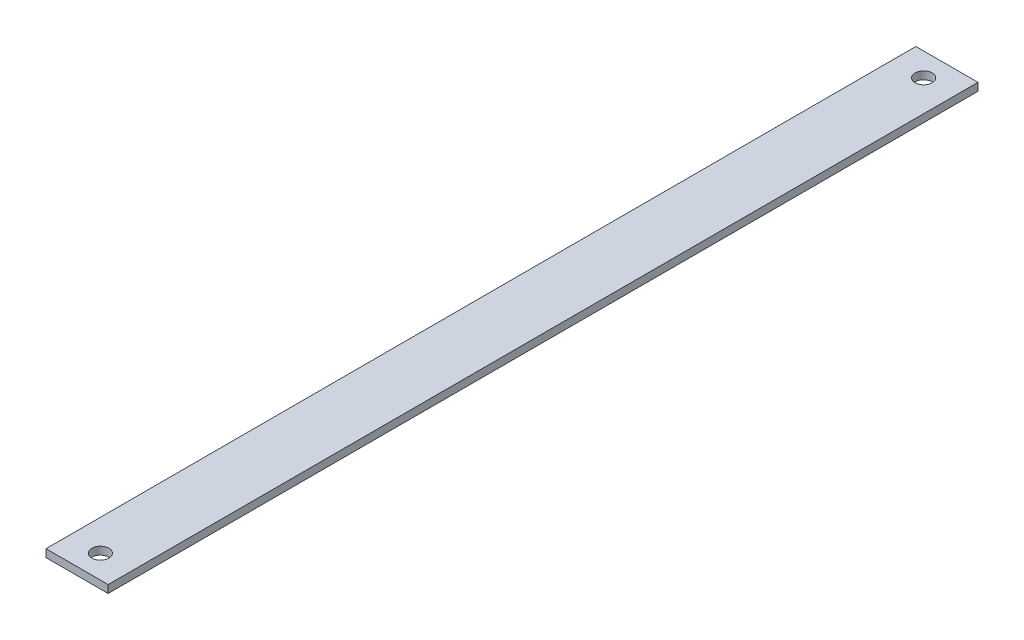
ISO-10303-21;
HEADER;
FILE_DESCRIPTION(('STEP AP214'),'2;1');
FILE_NAME('part.step','',(''),(''),'','','');
FILE_SCHEMA(('AUTOMOTIVE_DESIGN { 1 0 10303 214 1 1 1 1 }'));
ENDSEC;
DATA;
#1=APPLICATION_CONTEXT('core data for automotive mechanical design processes');
#2=APPLICATION_PROTOCOL_DEFINITION('international standard','automotive_design',2000,#1);
#3=PRODUCT_CONTEXT('',#1,'mechanical');
#4=PRODUCT('Part','Part','',(#3));
#5=PRODUCT_RELATED_PRODUCT_CATEGORY('part','',(#4));
#6=PRODUCT_DEFINITION_FORMATION('','',#4);
#7=PRODUCT_DEFINITION_CONTEXT('part definition',#1,'design');
#8=PRODUCT_DEFINITION('design','',#6,#7);
#9=PRODUCT_DEFINITION_SHAPE('','',#8);
#10=(LENGTH_UNIT() NAMED_UNIT(*) SI_UNIT(.MILLI.,.METRE.));
#11=(NAMED_UNIT(*) PLANE_ANGLE_UNIT() SI_UNIT($,.RADIAN.));
#12=(NAMED_UNIT(*) SI_UNIT($,.STERADIAN.) SOLID_ANGLE_UNIT());
#13=UNCERTAINTY_MEASURE_WITH_UNIT(LENGTH_MEASURE(1.E-05),#10,'distance_accuracy_value','');
#14=(GEOMETRIC_REPRESENTATION_CONTEXT(3) GLOBAL_UNCERTAINTY_ASSIGNED_CONTEXT((#13)) GLOBAL_UNIT_ASSIGNED_CONTEXT((#10,
#11,#12)) REPRESENTATION_CONTEXT('',''));
#15=CARTESIAN_POINT('',(0.,0.,0.));
#16=DIRECTION('',(0.,0.,1.));
#17=DIRECTION('',(1.,0.,0.));
#18=AXIS2_PLACEMENT_3D('',#15,#16,#17);
#19=CARTESIAN_POINT('',(0.,0.,560.));
#20=DIRECTION('',(1.,0.,0.));
#21=DIRECTION('',(0.,0.,-1.));
#22=AXIS2_PLACEMENT_3D('',#19,#20,#21);
#23=PLANE('',#22);
#24=DIRECTION('',(0.,-1.,0.));
#25=VECTOR('',#24,1.);
#26=CARTESIAN_POINT('',(0.,0.,0.));
#27=LINE('',#26,#25);
#28=CARTESIAN_POINT('',(0.,5.,0.));
#29=VERTEX_POINT('',#28);
#30=CARTESIAN_POINT('',(0.,0.,0.));
#31=VERTEX_POINT('',#30);
#32=EDGE_CURVE('E73',#29,#31,#27,.T.);
#33=ORIENTED_EDGE('',*,*,#32,.T.);
#34=DIRECTION('',(0.,0.,-1.));
#35=VECTOR('',#34,1.);
#36=CARTESIAN_POINT('',(0.,0.,560.));
#37=LINE('',#36,#35);
#38=CARTESIAN_POINT('',(0.,0.,560.));
#39=VERTEX_POINT('',#38);
#40=EDGE_CURVE('E11',#39,#31,#37,.T.);
#41=ORIENTED_EDGE('',*,*,#40,.F.);
#42=DIRECTION('',(0.,-1.,0.));
#43=VECTOR('',#42,1.);
#44=CARTESIAN_POINT('',(0.,0.,560.));
#45=LINE('',#44,#43);
#46=CARTESIAN_POINT('',(0.,5.,560.));
#47=VERTEX_POINT('',#46);
#48=EDGE_CURVE('E96',#47,#39,#45,.T.);
#49=ORIENTED_EDGE('',*,*,#48,.F.);
#50=DIRECTION('',(0.,0.,-1.));
#51=VECTOR('',#50,1.);
#52=CARTESIAN_POINT('',(0.,5.,560.));
#53=LINE('',#52,#51);
#54=EDGE_CURVE('E85',#47,#29,#53,.T.);
#55=ORIENTED_EDGE('',*,*,#54,.T.);
#56=EDGE_LOOP('',(#33,#41,#49,#55));
#57=FACE_BOUND('',#56,.T.);
#58=ADVANCED_FACE('F29',(#57),#23,.F.);
#59=CARTESIAN_POINT('',(0.,0.,560.));
#60=DIRECTION('',(0.,1.,0.));
#61=DIRECTION('',(0.,0.,1.));
#62=AXIS2_PLACEMENT_3D('',#59,#60,#61);
#63=PLANE('',#62);
#64=CARTESIAN_POINT('',(20.,0.,545.));
#65=DIRECTION('',(0.,1.,0.));
#66=DIRECTION('',(0.,0.,1.));
#67=AXIS2_PLACEMENT_3D('',#64,#65,#66);
#68=CIRCLE('',#67,5.5);
#69=CARTESIAN_POINT('',(20.,0.,550.5));
#70=VERTEX_POINT('',#69);
#71=EDGE_CURVE('E131',#70,#70,#68,.T.);
#72=ORIENTED_EDGE('',*,*,#71,.T.);
#73=EDGE_LOOP('',(#72));
#74=FACE_BOUND('',#73,.T.);
#75=CARTESIAN_POINT('',(20.,0.,15.));
#76=DIRECTION('',(0.,1.,0.));
#77=DIRECTION('',(0.,0.,1.));
#78=AXIS2_PLACEMENT_3D('',#75,#76,#77);
#79=CIRCLE('',#78,5.5);
#80=CARTESIAN_POINT('',(20.,0.,20.5));
#81=VERTEX_POINT('',#80);
#82=EDGE_CURVE('E86',#81,#81,#79,.T.);
#83=ORIENTED_EDGE('',*,*,#82,.T.);
#84=EDGE_LOOP('',(#83));
#85=FACE_BOUND('',#84,.T.);
#86=DIRECTION('',(1.,0.,0.));
#87=VECTOR('',#86,1.);
#88=CARTESIAN_POINT('',(0.,0.,0.));
#89=LINE('',#88,#87);
#90=CARTESIAN_POINT('',(40.,0.,0.));
#91=VERTEX_POINT('',#90);
#92=EDGE_CURVE('E69',#31,#91,#89,.T.);
#93=ORIENTED_EDGE('',*,*,#92,.T.);
#94=DIRECTION('',(0.,0.,-1.));
#95=VECTOR('',#94,1.);
#96=CARTESIAN_POINT('',(40.,0.,560.));
#97=LINE('',#96,#95);
#98=CARTESIAN_POINT('',(40.,0.,560.));
#99=VERTEX_POINT('',#98);
#100=EDGE_CURVE('E36',#99,#91,#97,.T.);
#101=ORIENTED_EDGE('',*,*,#100,.F.);
#102=DIRECTION('',(1.,0.,0.));
#103=VECTOR('',#102,1.);
#104=CARTESIAN_POINT('',(0.,0.,560.));
#105=LINE('',#104,#103);
#106=EDGE_CURVE('E81',#39,#99,#105,.T.);
#107=ORIENTED_EDGE('',*,*,#106,.F.);
#108=ORIENTED_EDGE('',*,*,#40,.T.);
#109=EDGE_LOOP('',(#93,#101,#107,#108));
#110=FACE_BOUND('',#109,.T.);
#111=ADVANCED_FACE('F80',(#74,#85,#110),#63,.F.);
#112=CARTESIAN_POINT('',(40.,0.,560.));
#113=DIRECTION('',(-1.,0.,0.));
#114=DIRECTION('',(0.,0.,1.));
#115=AXIS2_PLACEMENT_3D('',#112,#113,#114);
#116=PLANE('',#115);
#117=DIRECTION('',(0.,1.,0.));
#118=VECTOR('',#117,1.);
#119=CARTESIAN_POINT('',(40.,0.,0.));
#120=LINE('',#119,#118);
#121=CARTESIAN_POINT('',(40.,5.,0.));
#122=VERTEX_POINT('',#121);
#123=EDGE_CURVE('E74',#91,#122,#120,.T.);
#124=ORIENTED_EDGE('',*,*,#123,.T.);
#125=DIRECTION('',(0.,0.,-1.));
#126=VECTOR('',#125,1.);
#127=CARTESIAN_POINT('',(40.,5.,560.));
#128=LINE('',#127,#126);
#129=CARTESIAN_POINT('',(40.,5.,560.));
#130=VERTEX_POINT('',#129);
#131=EDGE_CURVE('E102',#130,#122,#128,.T.);
#132=ORIENTED_EDGE('',*,*,#131,.F.);
#133=DIRECTION('',(0.,1.,0.));
#134=VECTOR('',#133,1.);
#135=CARTESIAN_POINT('',(40.,0.,560.));
#136=LINE('',#135,#134);
#137=EDGE_CURVE('E48',#99,#130,#136,.T.);
#138=ORIENTED_EDGE('',*,*,#137,.F.);
#139=ORIENTED_EDGE('',*,*,#100,.T.);
#140=EDGE_LOOP('',(#124,#132,#138,#139));
#141=FACE_BOUND('',#140,.T.);
#142=ADVANCED_FACE('F105',(#141),#116,.F.);
#143=CARTESIAN_POINT('',(0.,5.,560.));
#144=DIRECTION('',(0.,-1.,0.));
#145=DIRECTION('',(0.,0.,-1.));
#146=AXIS2_PLACEMENT_3D('',#143,#144,#145);
#147=PLANE('',#146);
#148=CARTESIAN_POINT('',(20.,5.,545.));
#149=DIRECTION('',(0.,1.,0.));
#150=DIRECTION('',(0.,0.,1.));
#151=AXIS2_PLACEMENT_3D('',#148,#149,#150);
#152=CIRCLE('',#151,5.5);
#153=CARTESIAN_POINT('',(20.,5.,550.5));
#154=VERTEX_POINT('',#153);
#155=EDGE_CURVE('E141',#154,#154,#152,.T.);
#156=ORIENTED_EDGE('',*,*,#155,.F.);
#157=EDGE_LOOP('',(#156));
#158=FACE_BOUND('',#157,.T.);
#159=CARTESIAN_POINT('',(20.,5.,15.));
#160=DIRECTION('',(0.,1.,0.));
#161=DIRECTION('',(0.,0.,1.));
#162=AXIS2_PLACEMENT_3D('',#159,#160,#161);
#163=CIRCLE('',#162,5.5);
#164=CARTESIAN_POINT('',(20.,5.,20.5));
#165=VERTEX_POINT('',#164);
#166=EDGE_CURVE('E89',#165,#165,#163,.T.);
#167=ORIENTED_EDGE('',*,*,#166,.F.);
#168=EDGE_LOOP('',(#167));
#169=FACE_BOUND('',#168,.T.);
#170=DIRECTION('',(-1.,0.,0.));
#171=VECTOR('',#170,1.);
#172=CARTESIAN_POINT('',(0.,5.,0.));
#173=LINE('',#172,#171);
#174=EDGE_CURVE('E94',#122,#29,#173,.T.);
#175=ORIENTED_EDGE('',*,*,#174,.T.);
#176=ORIENTED_EDGE('',*,*,#54,.F.);
#177=DIRECTION('',(-1.,0.,0.));
#178=VECTOR('',#177,1.);
#179=CARTESIAN_POINT('',(0.,5.,560.));
#180=LINE('',#179,#178);
#181=EDGE_CURVE('E43',#130,#47,#180,.T.);
#182=ORIENTED_EDGE('',*,*,#181,.F.);
#183=ORIENTED_EDGE('',*,*,#131,.T.);
#184=EDGE_LOOP('',(#175,#176,#182,#183));
#185=FACE_BOUND('',#184,.T.);
#186=ADVANCED_FACE('F107',(#158,#169,#185),#147,.F.);
#187=CARTESIAN_POINT('',(0.,5.,560.));
#188=DIRECTION('',(0.,0.,-1.));
#189=DIRECTION('',(-1.,0.,0.));
#190=AXIS2_PLACEMENT_3D('',#187,#188,#189);
#191=PLANE('',#190);
#192=ORIENTED_EDGE('',*,*,#48,.T.);
#193=ORIENTED_EDGE('',*,*,#106,.T.);
#194=ORIENTED_EDGE('',*,*,#137,.T.);
#195=ORIENTED_EDGE('',*,*,#181,.T.);
#196=EDGE_LOOP('',(#192,#193,#194,#195));
#197=FACE_BOUND('',#196,.T.);
#198=ADVANCED_FACE('F108',(#197),#191,.F.);
#199=CARTESIAN_POINT('',(0.,5.,0.));
#200=DIRECTION('',(0.,0.,-1.));
#201=DIRECTION('',(-1.,0.,0.));
#202=AXIS2_PLACEMENT_3D('',#199,#200,#201);
#203=PLANE('',#202);
#204=ORIENTED_EDGE('',*,*,#32,.F.);
#205=ORIENTED_EDGE('',*,*,#174,.F.);
#206=ORIENTED_EDGE('',*,*,#123,.F.);
#207=ORIENTED_EDGE('',*,*,#92,.F.);
#208=EDGE_LOOP('',(#204,#205,#206,#207));
#209=FACE_BOUND('',#208,.T.);
#210=ADVANCED_FACE('F70',(#209),#203,.T.);
#211=CARTESIAN_POINT('',(20.,0.,15.));
#212=DIRECTION('',(0.,1.,0.));
#213=DIRECTION('',(0.,0.,1.));
#214=AXIS2_PLACEMENT_3D('',#211,#212,#213);
#215=CYLINDRICAL_SURFACE('',#214,5.5);
#216=ORIENTED_EDGE('',*,*,#82,.F.);
#217=EDGE_LOOP('',(#216));
#218=FACE_BOUND('',#217,.T.);
#219=ORIENTED_EDGE('',*,*,#166,.T.);
#220=EDGE_LOOP('',(#219));
#221=FACE_BOUND('',#220,.T.);
#222=ADVANCED_FACE('F115',(#218,#221),#215,.F.);
#223=CARTESIAN_POINT('',(20.,0.,545.));
#224=DIRECTION('',(0.,1.,0.));
#225=DIRECTION('',(0.,0.,1.));
#226=AXIS2_PLACEMENT_3D('',#223,#224,#225);
#227=CYLINDRICAL_SURFACE('',#226,5.5);
#228=ORIENTED_EDGE('',*,*,#71,.F.);
#229=EDGE_LOOP('',(#228));
#230=FACE_BOUND('',#229,.T.);
#231=ORIENTED_EDGE('',*,*,#155,.T.);
#232=EDGE_LOOP('',(#231));
#233=FACE_BOUND('',#232,.T.);
#234=ADVANCED_FACE('F136',(#230,#233),#227,.F.);
#235=CLOSED_SHELL('',(#58,#111,#142,#186,#198,#210,#222,#234));
#236=MANIFOLD_SOLID_BREP('B2',#235);
#237=ADVANCED_BREP_SHAPE_REPRESENTATION('',(#18,#236),#14);
#238=SHAPE_DEFINITION_REPRESENTATION(#9,#237);
ENDSEC;
END-ISO-10303-21;
